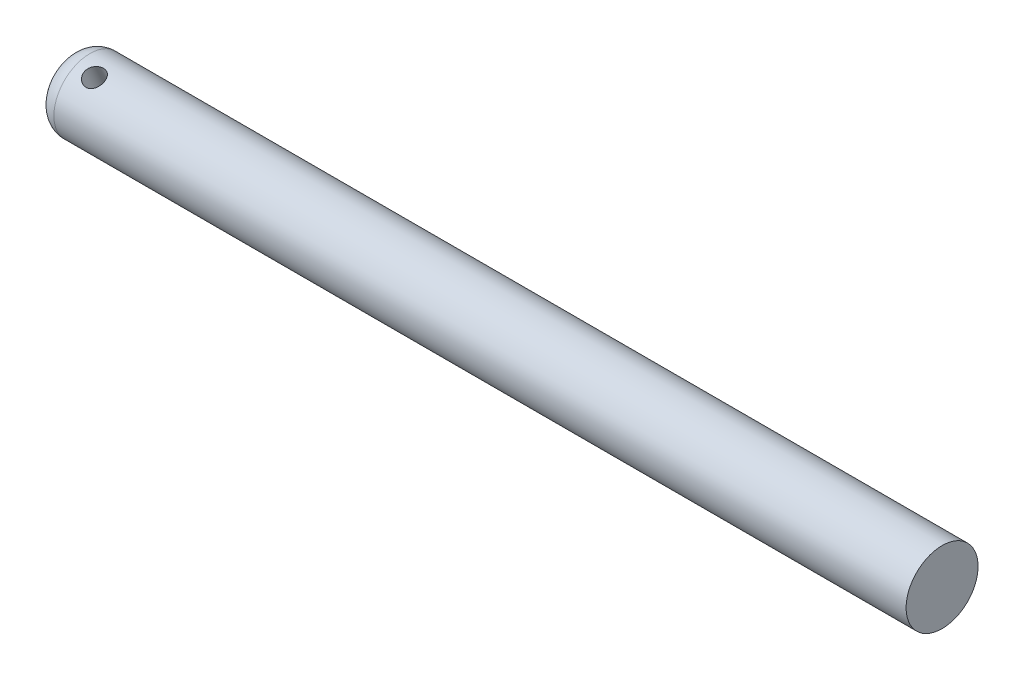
from build123d import *

# Parameters (mm, degrees)
ESQUISSE1_W                  = 45.54940715
ESQUISSE1_H                  = 1.881677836
ENL_V_MAT_EXTRU_1_DEPTH      = 10
ENL_V_MAT_EXTRU_1_DEPTH_BACK = 118.745100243
ESQUISSE3_R                  = 0.5
CONG_1_R                     = 1


with BuildPart() as part:
    # Esquisse1 → Base-R_volution (revolve)
    with BuildSketch(Plane.XY, mode=Mode.PRIVATE) as base_r_volution_sk:
        with Locations((-75.519145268, 152.745539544)):
            Rectangle(ESQUISSE1_W, ESQUISSE1_H)
    revolve(base_r_volution_sk.sketch.rotate(Axis((-98.293848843, 151.804700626, 0), (1, 0, 0)), 90), axis=Axis((-98.293848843, 151.804700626, 0), (1, 0, 0)))

    # Esquisse3 → Enl_v. mat.-Extru.1 (cut, two sides: drawn at the far end of the back side and taken through both)
    with BuildSketch(Plane(origin=(0, 126.2129241, 56.833202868), x_dir=(-1, 0, 0), z_dir=(0, 0.9118204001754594, 0.4105892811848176)).offset(-ENL_V_MAT_EXTRU_1_DEPTH_BACK)):
        with Locations(Location((96.293848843, -62.329382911, 0), (0, 0, 90))):
            Circle(ESQUISSE3_R)
    extrude(amount=ENL_V_MAT_EXTRU_1_DEPTH + ENL_V_MAT_EXTRU_1_DEPTH_BACK, mode=Mode.SUBTRACT)

    # Cong_1
    cong_1_edges = [part.edges().sort_by_distance(p)[0] for p in [
        (-98.293848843, 151.804700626, -1.881677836),
    ]]
    fillet(cong_1_edges, radius=CONG_1_R)


solid = part.part
